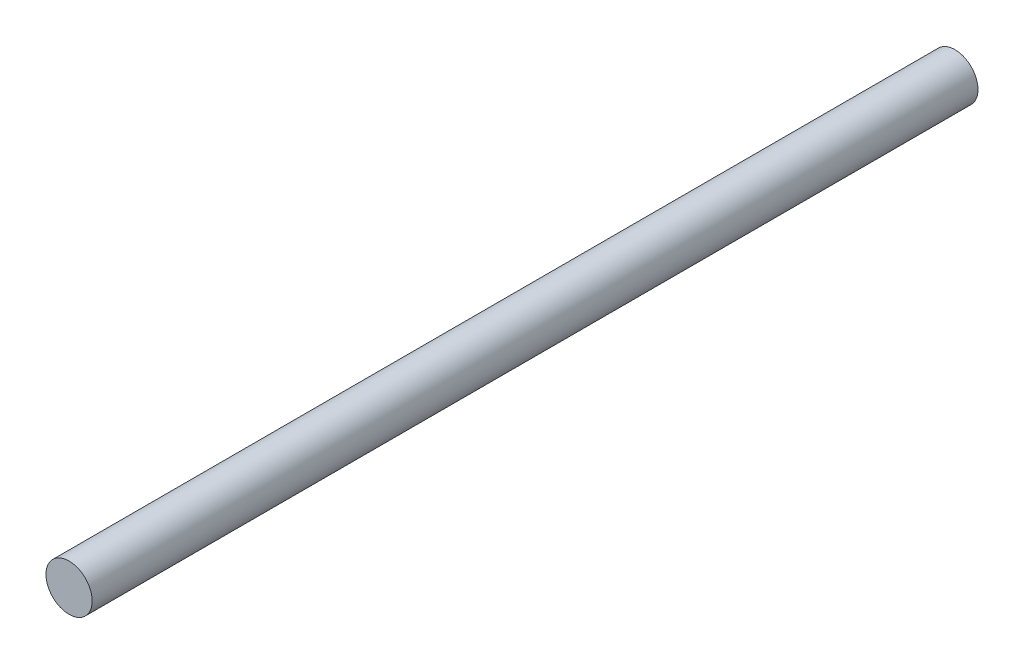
ISO-10303-21;
HEADER;
FILE_DESCRIPTION(('STEP AP214'),'2;1');
FILE_NAME('part.step','',(''),(''),'','','');
FILE_SCHEMA(('AUTOMOTIVE_DESIGN { 1 0 10303 214 1 1 1 1 }'));
ENDSEC;
DATA;
#1=APPLICATION_CONTEXT('core data for automotive mechanical design processes');
#2=APPLICATION_PROTOCOL_DEFINITION('international standard','automotive_design',2000,#1);
#3=PRODUCT_CONTEXT('',#1,'mechanical');
#4=PRODUCT('Part','Part','',(#3));
#5=PRODUCT_RELATED_PRODUCT_CATEGORY('part','',(#4));
#6=PRODUCT_DEFINITION_FORMATION('','',#4);
#7=PRODUCT_DEFINITION_CONTEXT('part definition',#1,'design');
#8=PRODUCT_DEFINITION('design','',#6,#7);
#9=PRODUCT_DEFINITION_SHAPE('','',#8);
#10=(LENGTH_UNIT() NAMED_UNIT(*) SI_UNIT(.MILLI.,.METRE.));
#11=(NAMED_UNIT(*) PLANE_ANGLE_UNIT() SI_UNIT($,.RADIAN.));
#12=(NAMED_UNIT(*) SI_UNIT($,.STERADIAN.) SOLID_ANGLE_UNIT());
#13=UNCERTAINTY_MEASURE_WITH_UNIT(LENGTH_MEASURE(1.E-05),#10,'distance_accuracy_value','');
#14=(GEOMETRIC_REPRESENTATION_CONTEXT(3) GLOBAL_UNCERTAINTY_ASSIGNED_CONTEXT((#13)) GLOBAL_UNIT_ASSIGNED_CONTEXT((#10,
#11,#12)) REPRESENTATION_CONTEXT('',''));
#15=CARTESIAN_POINT('',(0.,0.,0.));
#16=DIRECTION('',(0.,0.,1.));
#17=DIRECTION('',(1.,0.,0.));
#18=AXIS2_PLACEMENT_3D('',#15,#16,#17);
#19=CARTESIAN_POINT('',(0.,0.,-1150.));
#20=DIRECTION('',(0.,0.,1.));
#21=DIRECTION('',(1.,0.,0.));
#22=AXIS2_PLACEMENT_3D('',#19,#20,#21);
#23=CYLINDRICAL_SURFACE('',#22,30.);
#24=CARTESIAN_POINT('',(0.,0.,-1150.));
#25=DIRECTION('',(0.,0.,1.));
#26=DIRECTION('',(1.,0.,0.));
#27=AXIS2_PLACEMENT_3D('',#24,#25,#26);
#28=CIRCLE('',#27,30.);
#29=CARTESIAN_POINT('',(30.,0.,-1150.));
#30=VERTEX_POINT('',#29);
#31=EDGE_CURVE('E10',#30,#30,#28,.T.);
#32=ORIENTED_EDGE('',*,*,#31,.T.);
#33=EDGE_LOOP('',(#32));
#34=FACE_BOUND('',#33,.T.);
#35=CARTESIAN_POINT('',(0.,0.,0.));
#36=DIRECTION('',(0.,0.,1.));
#37=DIRECTION('',(1.,0.,0.));
#38=AXIS2_PLACEMENT_3D('',#35,#36,#37);
#39=CIRCLE('',#38,30.);
#40=CARTESIAN_POINT('',(30.,0.,0.));
#41=VERTEX_POINT('',#40);
#42=EDGE_CURVE('E40',#41,#41,#39,.T.);
#43=ORIENTED_EDGE('',*,*,#42,.F.);
#44=EDGE_LOOP('',(#43));
#45=FACE_BOUND('',#44,.T.);
#46=ADVANCED_FACE('F37',(#34,#45),#23,.T.);
#47=CARTESIAN_POINT('',(0.,0.,-1150.));
#48=DIRECTION('',(0.,0.,1.));
#49=DIRECTION('',(1.,0.,0.));
#50=AXIS2_PLACEMENT_3D('',#47,#48,#49);
#51=PLANE('',#50);
#52=ORIENTED_EDGE('',*,*,#31,.F.);
#53=EDGE_LOOP('',(#52));
#54=FACE_BOUND('',#53,.T.);
#55=ADVANCED_FACE('F54',(#54),#51,.F.);
#56=CARTESIAN_POINT('',(0.,0.,0.));
#57=DIRECTION('',(0.,0.,1.));
#58=DIRECTION('',(1.,0.,0.));
#59=AXIS2_PLACEMENT_3D('',#56,#57,#58);
#60=PLANE('',#59);
#61=ORIENTED_EDGE('',*,*,#42,.T.);
#62=EDGE_LOOP('',(#61));
#63=FACE_BOUND('',#62,.T.);
#64=ADVANCED_FACE('F51',(#63),#60,.T.);
#65=CLOSED_SHELL('',(#46,#55,#64));
#66=MANIFOLD_SOLID_BREP('B2',#65);
#67=ADVANCED_BREP_SHAPE_REPRESENTATION('',(#18,#66),#14);
#68=SHAPE_DEFINITION_REPRESENTATION(#9,#67);
ENDSEC;
END-ISO-10303-21;
